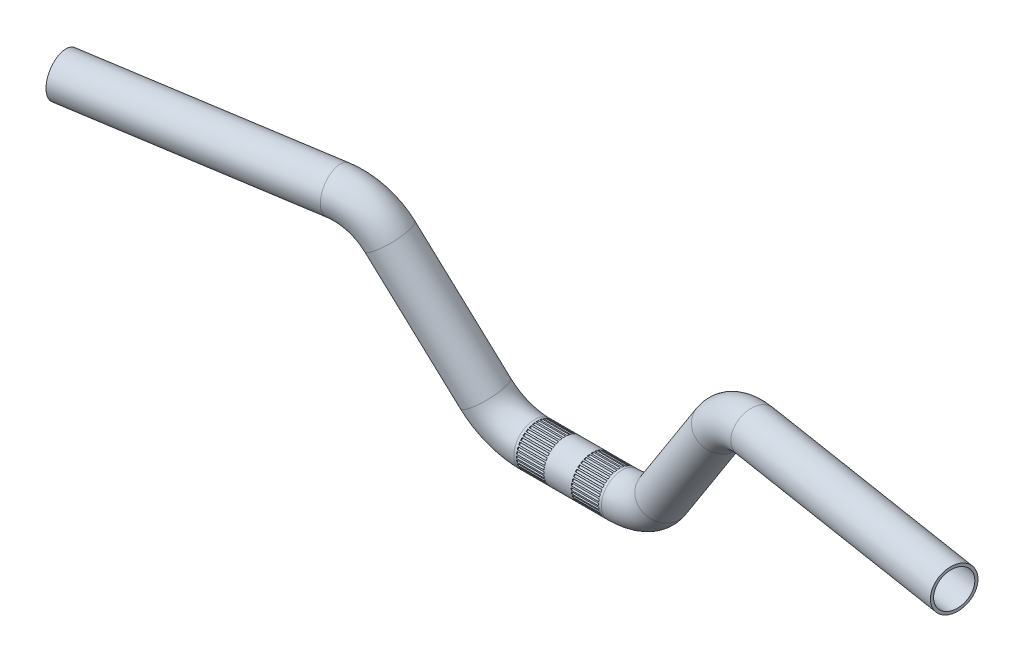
from build123d import *

# Parameters (mm, degrees)
SKETCH3_R                = 19
SKETCH3_R_2              = 16.46
CUT_EXTRUDE1_START       = -12.5
SKETCH4_R                = 1
CUT_EXTRUDE1_DEPTH       = 25
CIRPATTERN1_COUNT        = 36
MIRROR2_START            = -12.5
MIRROR2_COPY_1_SKETCH_R  = 1
MIRROR2_COPY_1_DEPTH     = 25
MIRROR2_COPY_2_SKETCH_R  = 1
MIRROR2_COPY_2_DEPTH     = 25
MIRROR2_COPY_3_SKETCH_R  = 1
MIRROR2_COPY_3_DEPTH     = 25
MIRROR2_COPY_4_SKETCH_R  = 1
MIRROR2_COPY_4_DEPTH     = 25
MIRROR2_COPY_5_SKETCH_R  = 1
MIRROR2_COPY_5_DEPTH     = 25
MIRROR2_COPY_6_SKETCH_R  = 1
MIRROR2_COPY_6_DEPTH     = 25
MIRROR2_COPY_7_SKETCH_R  = 1
MIRROR2_COPY_7_DEPTH     = 25
MIRROR2_COPY_8_SKETCH_R  = 1
MIRROR2_COPY_8_DEPTH     = 25
MIRROR2_COPY_9_SKETCH_R  = 1
MIRROR2_COPY_9_DEPTH     = 25
MIRROR2_COPY_10_SKETCH_R = 1
MIRROR2_COPY_10_DEPTH    = 25
MIRROR2_COPY_11_SKETCH_R = 1
MIRROR2_COPY_11_DEPTH    = 25
MIRROR2_COPY_12_SKETCH_R = 1
MIRROR2_COPY_12_DEPTH    = 25
MIRROR2_COPY_13_SKETCH_R = 1
MIRROR2_COPY_13_DEPTH    = 25
MIRROR2_COPY_14_SKETCH_R = 1
MIRROR2_COPY_14_DEPTH    = 25
MIRROR2_COPY_15_SKETCH_R = 1
MIRROR2_COPY_15_DEPTH    = 25
MIRROR2_COPY_16_SKETCH_R = 1
MIRROR2_COPY_16_DEPTH    = 25
MIRROR2_COPY_17_SKETCH_R = 1
MIRROR2_COPY_17_DEPTH    = 25
MIRROR2_COPY_18_SKETCH_R = 1
MIRROR2_COPY_18_DEPTH    = 25
MIRROR2_COPY_19_SKETCH_R = 1
MIRROR2_COPY_19_DEPTH    = 25
MIRROR2_COPY_20_SKETCH_R = 1
MIRROR2_COPY_20_DEPTH    = 25
MIRROR2_COPY_21_SKETCH_R = 1
MIRROR2_COPY_21_DEPTH    = 25
MIRROR2_COPY_22_SKETCH_R = 1
MIRROR2_COPY_22_DEPTH    = 25
MIRROR2_COPY_23_SKETCH_R = 1
MIRROR2_COPY_23_DEPTH    = 25
MIRROR2_COPY_24_SKETCH_R = 1
MIRROR2_COPY_24_DEPTH    = 25
MIRROR2_COPY_25_SKETCH_R = 1
MIRROR2_COPY_25_DEPTH    = 25
MIRROR2_COPY_26_SKETCH_R = 1
MIRROR2_COPY_26_DEPTH    = 25
MIRROR2_COPY_27_SKETCH_R = 1
MIRROR2_COPY_27_DEPTH    = 25
MIRROR2_COPY_28_SKETCH_R = 1
MIRROR2_COPY_28_DEPTH    = 25
MIRROR2_COPY_29_SKETCH_R = 1
MIRROR2_COPY_29_DEPTH    = 25
MIRROR2_COPY_30_SKETCH_R = 1
MIRROR2_COPY_30_DEPTH    = 25
MIRROR2_COPY_31_SKETCH_R = 1
MIRROR2_COPY_31_DEPTH    = 25
MIRROR2_COPY_32_SKETCH_R = 1
MIRROR2_COPY_32_DEPTH    = 25
MIRROR2_COPY_33_SKETCH_R = 1
MIRROR2_COPY_33_DEPTH    = 25
MIRROR2_COPY_34_SKETCH_R = 1
MIRROR2_COPY_34_DEPTH    = 25
MIRROR2_COPY_35_SKETCH_R = 1
MIRROR2_COPY_35_DEPTH    = 25


with BuildPart() as part:
    # Sweep-Thin1: sweep along a curve in space
    with BuildLine() as sweep_thin1_path:
        Line((0, 0, 0), (39.91103885, 0, 0))
        ThreePointArc((39.91103885, 0, 0), (63.068596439, 5.594701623, 1.015038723), (80.959167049, 21.106339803, 3.829293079))
        Line((80.959167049, 21.106339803, 3.829293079), (150.432683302, 119.391427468, 21.661016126))
        ThreePointArc((150.432683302, 119.391427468, 21.661016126), (167.811983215, 134.550140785, 25.463054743), (190.200795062, 140, 29.377424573))
        Line((190.200795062, 140, 29.377424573), (406.4, 140, 63.5))
    # Sketch3 → Sweep-Thin1 (sweep)
    with BuildSketch(Plane(origin=(0, 0, 0), x_dir=(0, 0, -1), z_dir=(1, 0, 0))):
        Circle(SKETCH3_R)
        Circle(SKETCH3_R_2, mode=Mode.SUBTRACT)
    sweep_thin1 = sweep(path=sweep_thin1_path.line)

    # Mirror1: Sweep-Thin1 across plane
    add(sweep_thin1.mirror(Plane(origin=(0, 0, 0), x_dir=(0, 0, 1), z_dir=(1, 0, 0))))

    # Sketch4 → Cut-Extrude1 (cut)
    with BuildSketch(Plane(origin=(0, 0, 0), x_dir=(0, 0, -1), z_dir=(1, 0, 0)).offset(CUT_EXTRUDE1_START)):
        with Locations((0, -19)):
            Circle(SKETCH4_R)
    cut_extrude1 = extrude(amount=-CUT_EXTRUDE1_DEPTH, mode=Mode.SUBTRACT)

    # CirPattern1: Cut-Extrude1 ×36 about axis
    cirpattern1_axis = Axis((0, 0, 0), (1, 0, 0))
    for i in range(1, CIRPATTERN1_COUNT):
        add(cut_extrude1.rotate(cirpattern1_axis, i * 360 / CIRPATTERN1_COUNT), mode=Mode.SUBTRACT)

    # Mirror2: Cut-Extrude1 across plane
    add(cut_extrude1.mirror(Plane(origin=(0, 0, 0), x_dir=(0, 0, 1), z_dir=(1, 0, 0))), mode=Mode.SUBTRACT)

    # Mirror2 copy 1 sketch → Mirror2 copy 1 (cut)
    with BuildSketch(Plane(origin=(0, 0, 0), x_dir=(0, 0.17364817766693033, -0.984807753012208), z_dir=(-1, 0, 0)).offset(MIRROR2_START)):
        with Locations((0, 19)):
            Circle(MIRROR2_COPY_1_SKETCH_R)
    extrude(amount=-MIRROR2_COPY_1_DEPTH, mode=Mode.SUBTRACT)

    # Mirror2 copy 2 sketch → Mirror2 copy 2 (cut)
    with BuildSketch(Plane(origin=(0, 0, 0), x_dir=(0, 0.3420201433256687, -0.9396926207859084), z_dir=(-1, 0, 0)).offset(MIRROR2_START)):
        with Locations((0, 19)):
            Circle(MIRROR2_COPY_2_SKETCH_R)
    extrude(amount=-MIRROR2_COPY_2_DEPTH, mode=Mode.SUBTRACT)

    # Mirror2 copy 3 sketch → Mirror2 copy 3 (cut)
    with BuildSketch(Plane(origin=(0, 0, 0), x_dir=(0, 0.49999999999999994, -0.8660254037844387), z_dir=(-1, 0, 0)).offset(MIRROR2_START)):
        with Locations((0, 19)):
            Circle(MIRROR2_COPY_3_SKETCH_R)
    extrude(amount=-MIRROR2_COPY_3_DEPTH, mode=Mode.SUBTRACT)

    # Mirror2 copy 4 sketch → Mirror2 copy 4 (cut)
    with BuildSketch(Plane(origin=(0, 0, 0), x_dir=(0, 0.6427876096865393, -0.766044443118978), z_dir=(-1, 0, 0)).offset(MIRROR2_START)):
        with Locations((0, 19)):
            Circle(MIRROR2_COPY_4_SKETCH_R)
    extrude(amount=-MIRROR2_COPY_4_DEPTH, mode=Mode.SUBTRACT)

    # Mirror2 copy 5 sketch → Mirror2 copy 5 (cut)
    with BuildSketch(Plane(origin=(0, 0, 0), x_dir=(0, 0.766044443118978, -0.6427876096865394), z_dir=(-1, 0, 0)).offset(MIRROR2_START)):
        with Locations((0, 19)):
            Circle(MIRROR2_COPY_5_SKETCH_R)
    extrude(amount=-MIRROR2_COPY_5_DEPTH, mode=Mode.SUBTRACT)

    # Mirror2 copy 6 sketch → Mirror2 copy 6 (cut)
    with BuildSketch(Plane(origin=(0, 0, 0), x_dir=(0, 0.8660254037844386, -0.5000000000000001), z_dir=(-1, 0, 0)).offset(MIRROR2_START)):
        with Locations((0, 19)):
            Circle(MIRROR2_COPY_6_SKETCH_R)
    extrude(amount=-MIRROR2_COPY_6_DEPTH, mode=Mode.SUBTRACT)

    # Mirror2 copy 7 sketch → Mirror2 copy 7 (cut)
    with BuildSketch(Plane(origin=(0, 0, 0), x_dir=(0, 0.9396926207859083, -0.3420201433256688), z_dir=(-1, 0, 0)).offset(MIRROR2_START)):
        with Locations((0, 19)):
            Circle(MIRROR2_COPY_7_SKETCH_R)
    extrude(amount=-MIRROR2_COPY_7_DEPTH, mode=Mode.SUBTRACT)

    # Mirror2 copy 8 sketch → Mirror2 copy 8 (cut)
    with BuildSketch(Plane(origin=(0, 0, 0), x_dir=(0, 0.984807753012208, -0.17364817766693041), z_dir=(-1, 0, 0)).offset(MIRROR2_START)):
        with Locations((0, 19)):
            Circle(MIRROR2_COPY_8_SKETCH_R)
    extrude(amount=-MIRROR2_COPY_8_DEPTH, mode=Mode.SUBTRACT)

    # Mirror2 copy 9 sketch → Mirror2 copy 9 (cut)
    with BuildSketch(Plane(origin=(0, 0, 0), x_dir=(0, 1, 0), z_dir=(-1, 0, 0)).offset(MIRROR2_START)):
        with Locations((0, 19)):
            Circle(MIRROR2_COPY_9_SKETCH_R)
    extrude(amount=-MIRROR2_COPY_9_DEPTH, mode=Mode.SUBTRACT)

    # Mirror2 copy 10 sketch → Mirror2 copy 10 (cut)
    with BuildSketch(Plane(origin=(0, 0, 0), x_dir=(0, 0.984807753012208, 0.1736481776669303), z_dir=(-1, 0, 0)).offset(MIRROR2_START)):
        with Locations((0, 19)):
            Circle(MIRROR2_COPY_10_SKETCH_R)
    extrude(amount=-MIRROR2_COPY_10_DEPTH, mode=Mode.SUBTRACT)

    # Mirror2 copy 11 sketch → Mirror2 copy 11 (cut)
    with BuildSketch(Plane(origin=(0, 0, 0), x_dir=(0, 0.9396926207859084, 0.3420201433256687), z_dir=(-1, 0, 0)).offset(MIRROR2_START)):
        with Locations((0, 19)):
            Circle(MIRROR2_COPY_11_SKETCH_R)
    extrude(amount=-MIRROR2_COPY_11_DEPTH, mode=Mode.SUBTRACT)

    # Mirror2 copy 12 sketch → Mirror2 copy 12 (cut)
    with BuildSketch(Plane(origin=(0, 0, 0), x_dir=(0, 0.8660254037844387, 0.4999999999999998), z_dir=(-1, 0, 0)).offset(MIRROR2_START)):
        with Locations((0, 19)):
            Circle(MIRROR2_COPY_12_SKETCH_R)
    extrude(amount=-MIRROR2_COPY_12_DEPTH, mode=Mode.SUBTRACT)

    # Mirror2 copy 13 sketch → Mirror2 copy 13 (cut)
    with BuildSketch(Plane(origin=(0, 0, 0), x_dir=(0, 0.766044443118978, 0.6427876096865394), z_dir=(-1, 0, 0)).offset(MIRROR2_START)):
        with Locations((0, 19)):
            Circle(MIRROR2_COPY_13_SKETCH_R)
    extrude(amount=-MIRROR2_COPY_13_DEPTH, mode=Mode.SUBTRACT)

    # Mirror2 copy 14 sketch → Mirror2 copy 14 (cut)
    with BuildSketch(Plane(origin=(0, 0, 0), x_dir=(0, 0.6427876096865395, 0.7660444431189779), z_dir=(-1, 0, 0)).offset(MIRROR2_START)):
        with Locations((0, 19)):
            Circle(MIRROR2_COPY_14_SKETCH_R)
    extrude(amount=-MIRROR2_COPY_14_DEPTH, mode=Mode.SUBTRACT)

    # Mirror2 copy 15 sketch → Mirror2 copy 15 (cut)
    with BuildSketch(Plane(origin=(0, 0, 0), x_dir=(0, 0.49999999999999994, 0.8660254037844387), z_dir=(-1, 0, 0)).offset(MIRROR2_START)):
        with Locations((0, 19)):
            Circle(MIRROR2_COPY_15_SKETCH_R)
    extrude(amount=-MIRROR2_COPY_15_DEPTH, mode=Mode.SUBTRACT)

    # Mirror2 copy 16 sketch → Mirror2 copy 16 (cut)
    with BuildSketch(Plane(origin=(0, 0, 0), x_dir=(0, 0.3420201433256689, 0.9396926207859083), z_dir=(-1, 0, 0)).offset(MIRROR2_START)):
        with Locations((0, 19)):
            Circle(MIRROR2_COPY_16_SKETCH_R)
    extrude(amount=-MIRROR2_COPY_16_DEPTH, mode=Mode.SUBTRACT)

    # Mirror2 copy 17 sketch → Mirror2 copy 17 (cut)
    with BuildSketch(Plane(origin=(0, 0, 0), x_dir=(0, 0.17364817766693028, 0.984807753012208), z_dir=(-1, 0, 0)).offset(MIRROR2_START)):
        with Locations((0, 19)):
            Circle(MIRROR2_COPY_17_SKETCH_R)
    extrude(amount=-MIRROR2_COPY_17_DEPTH, mode=Mode.SUBTRACT)

    # Mirror2 copy 18 sketch → Mirror2 copy 18 (cut)
    with BuildSketch(Plane.ZY.offset(MIRROR2_START)):
        with Locations((0, 19)):
            Circle(MIRROR2_COPY_18_SKETCH_R)
    extrude(amount=-MIRROR2_COPY_18_DEPTH, mode=Mode.SUBTRACT)

    # Mirror2 copy 19 sketch → Mirror2 copy 19 (cut)
    with BuildSketch(Plane(origin=(0, 0, 0), x_dir=(0, -0.17364817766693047, 0.984807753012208), z_dir=(-1, 0, 0)).offset(MIRROR2_START)):
        with Locations((0, 19)):
            Circle(MIRROR2_COPY_19_SKETCH_R)
    extrude(amount=-MIRROR2_COPY_19_DEPTH, mode=Mode.SUBTRACT)

    # Mirror2 copy 20 sketch → Mirror2 copy 20 (cut)
    with BuildSketch(Plane(origin=(0, 0, 0), x_dir=(0, -0.34202014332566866, 0.9396926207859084), z_dir=(-1, 0, 0)).offset(MIRROR2_START)):
        with Locations((0, 19)):
            Circle(MIRROR2_COPY_20_SKETCH_R)
    extrude(amount=-MIRROR2_COPY_20_DEPTH, mode=Mode.SUBTRACT)

    # Mirror2 copy 21 sketch → Mirror2 copy 21 (cut)
    with BuildSketch(Plane(origin=(0, 0, 0), x_dir=(0, -0.5000000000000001, 0.8660254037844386), z_dir=(-1, 0, 0)).offset(MIRROR2_START)):
        with Locations((0, 19)):
            Circle(MIRROR2_COPY_21_SKETCH_R)
    extrude(amount=-MIRROR2_COPY_21_DEPTH, mode=Mode.SUBTRACT)

    # Mirror2 copy 22 sketch → Mirror2 copy 22 (cut)
    with BuildSketch(Plane(origin=(0, 0, 0), x_dir=(0, -0.6427876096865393, 0.766044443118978), z_dir=(-1, 0, 0)).offset(MIRROR2_START)):
        with Locations((0, 19)):
            Circle(MIRROR2_COPY_22_SKETCH_R)
    extrude(amount=-MIRROR2_COPY_22_DEPTH, mode=Mode.SUBTRACT)

    # Mirror2 copy 23 sketch → Mirror2 copy 23 (cut)
    with BuildSketch(Plane(origin=(0, 0, 0), x_dir=(0, -0.7660444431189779, 0.6427876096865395), z_dir=(-1, 0, 0)).offset(MIRROR2_START)):
        with Locations((0, 19)):
            Circle(MIRROR2_COPY_23_SKETCH_R)
    extrude(amount=-MIRROR2_COPY_23_DEPTH, mode=Mode.SUBTRACT)

    # Mirror2 copy 24 sketch → Mirror2 copy 24 (cut)
    with BuildSketch(Plane(origin=(0, 0, 0), x_dir=(0, -0.8660254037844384, 0.5000000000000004), z_dir=(-1, 0, 0)).offset(MIRROR2_START)):
        with Locations((0, 19)):
            Circle(MIRROR2_COPY_24_SKETCH_R)
    extrude(amount=-MIRROR2_COPY_24_DEPTH, mode=Mode.SUBTRACT)

    # Mirror2 copy 25 sketch → Mirror2 copy 25 (cut)
    with BuildSketch(Plane(origin=(0, 0, 0), x_dir=(0, -0.9396926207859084, 0.34202014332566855), z_dir=(-1, 0, 0)).offset(MIRROR2_START)):
        with Locations((0, 19)):
            Circle(MIRROR2_COPY_25_SKETCH_R)
    extrude(amount=-MIRROR2_COPY_25_DEPTH, mode=Mode.SUBTRACT)

    # Mirror2 copy 26 sketch → Mirror2 copy 26 (cut)
    with BuildSketch(Plane(origin=(0, 0, 0), x_dir=(0, -0.984807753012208, 0.17364817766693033), z_dir=(-1, 0, 0)).offset(MIRROR2_START)):
        with Locations((0, 19)):
            Circle(MIRROR2_COPY_26_SKETCH_R)
    extrude(amount=-MIRROR2_COPY_26_DEPTH, mode=Mode.SUBTRACT)

    # Mirror2 copy 27 sketch → Mirror2 copy 27 (cut)
    with BuildSketch(Plane(origin=(0, 0, 0), x_dir=(0, -1, 0), z_dir=(-1, 0, 0)).offset(MIRROR2_START)):
        with Locations((0, 19)):
            Circle(MIRROR2_COPY_27_SKETCH_R)
    extrude(amount=-MIRROR2_COPY_27_DEPTH, mode=Mode.SUBTRACT)

    # Mirror2 copy 28 sketch → Mirror2 copy 28 (cut)
    with BuildSketch(Plane(origin=(0, 0, 0), x_dir=(0, -0.9848077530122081, -0.17364817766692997), z_dir=(-1, 0, 0)).offset(MIRROR2_START)):
        with Locations((0, 19)):
            Circle(MIRROR2_COPY_28_SKETCH_R)
    extrude(amount=-MIRROR2_COPY_28_DEPTH, mode=Mode.SUBTRACT)

    # Mirror2 copy 29 sketch → Mirror2 copy 29 (cut)
    with BuildSketch(Plane(origin=(0, 0, 0), x_dir=(0, -0.9396926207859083, -0.342020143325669), z_dir=(-1, 0, 0)).offset(MIRROR2_START)):
        with Locations((0, 19)):
            Circle(MIRROR2_COPY_29_SKETCH_R)
    extrude(amount=-MIRROR2_COPY_29_DEPTH, mode=Mode.SUBTRACT)

    # Mirror2 copy 30 sketch → Mirror2 copy 30 (cut)
    with BuildSketch(Plane(origin=(0, 0, 0), x_dir=(0, -0.8660254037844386, -0.5000000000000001), z_dir=(-1, 0, 0)).offset(MIRROR2_START)):
        with Locations((0, 19)):
            Circle(MIRROR2_COPY_30_SKETCH_R)
    extrude(amount=-MIRROR2_COPY_30_DEPTH, mode=Mode.SUBTRACT)

    # Mirror2 copy 31 sketch → Mirror2 copy 31 (cut)
    with BuildSketch(Plane(origin=(0, 0, 0), x_dir=(0, -0.7660444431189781, -0.6427876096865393), z_dir=(-1, 0, 0)).offset(MIRROR2_START)):
        with Locations((0, 19)):
            Circle(MIRROR2_COPY_31_SKETCH_R)
    extrude(amount=-MIRROR2_COPY_31_DEPTH, mode=Mode.SUBTRACT)

    # Mirror2 copy 32 sketch → Mirror2 copy 32 (cut)
    with BuildSketch(Plane(origin=(0, 0, 0), x_dir=(0, -0.6427876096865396, -0.7660444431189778), z_dir=(-1, 0, 0)).offset(MIRROR2_START)):
        with Locations((0, 19)):
            Circle(MIRROR2_COPY_32_SKETCH_R)
    extrude(amount=-MIRROR2_COPY_32_DEPTH, mode=Mode.SUBTRACT)

    # Mirror2 copy 33 sketch → Mirror2 copy 33 (cut)
    with BuildSketch(Plane(origin=(0, 0, 0), x_dir=(0, -0.5000000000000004, -0.8660254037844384), z_dir=(-1, 0, 0)).offset(MIRROR2_START)):
        with Locations((0, 19)):
            Circle(MIRROR2_COPY_33_SKETCH_R)
    extrude(amount=-MIRROR2_COPY_33_DEPTH, mode=Mode.SUBTRACT)

    # Mirror2 copy 34 sketch → Mirror2 copy 34 (cut)
    with BuildSketch(Plane(origin=(0, 0, 0), x_dir=(0, -0.3420201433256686, -0.9396926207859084), z_dir=(-1, 0, 0)).offset(MIRROR2_START)):
        with Locations((0, 19)):
            Circle(MIRROR2_COPY_34_SKETCH_R)
    extrude(amount=-MIRROR2_COPY_34_DEPTH, mode=Mode.SUBTRACT)

    # Mirror2 copy 35 sketch → Mirror2 copy 35 (cut)
    with BuildSketch(Plane(origin=(0, 0, 0), x_dir=(0, -0.1736481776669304, -0.984807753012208), z_dir=(-1, 0, 0)).offset(MIRROR2_START)):
        with Locations((0, 19)):
            Circle(MIRROR2_COPY_35_SKETCH_R)
    extrude(amount=-MIRROR2_COPY_35_DEPTH, mode=Mode.SUBTRACT)


solid = part.part
